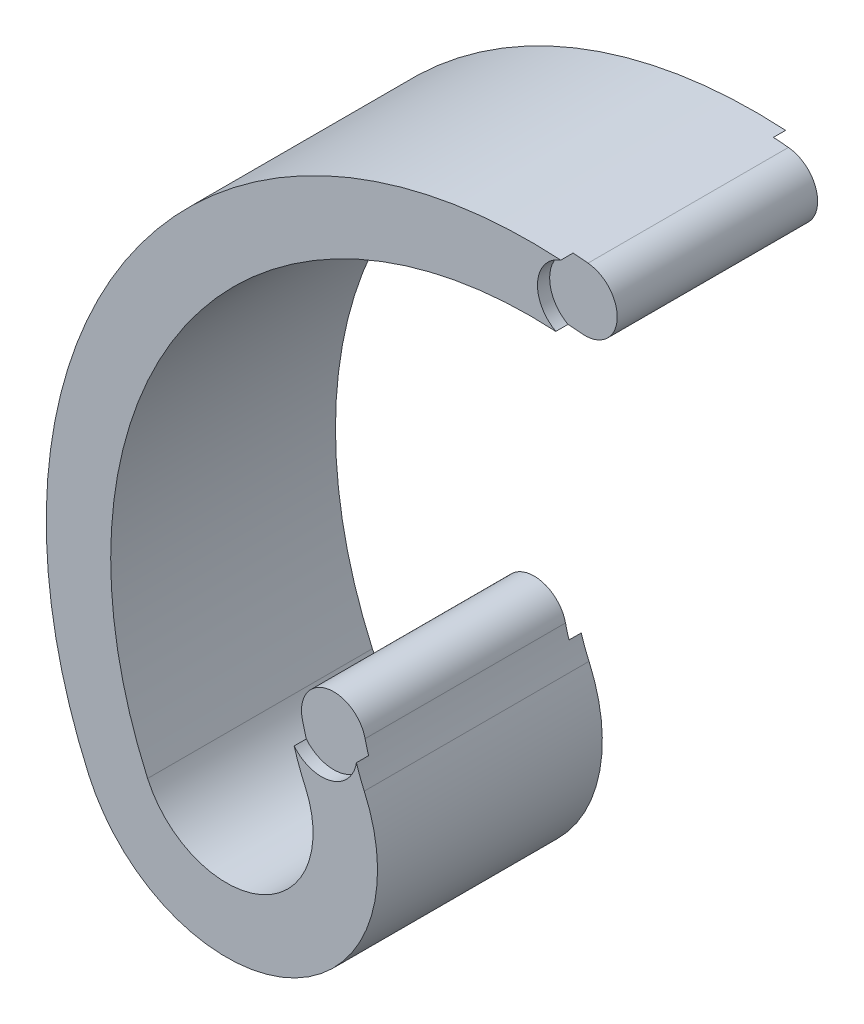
from build123d import *

# Parameters (mm, degrees)
LINEAR_AUSTRAGEN_D_NN1_DEPTH    = 143
SKIZZE2_R                       = 41
LINEAR_AUSTRAGEN1_DEPTH         = 286
SKIZZE3_R                       = 45
SCHNITT_LINEAR_AUSTRAGEN1_DEPTH = 15.5


with BuildPart() as part:
    # Skizze1 → Linear-Austragen-D_nn1 (new, symmetric)
    with BuildSketch(Plane.XY):
        with BuildLine():
            ThreePointArc((-305.946239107, -70.735690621), (-297.599415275, -100.205923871), (-286.421168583, -128.722777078))
            ThreePointArc((-286.421168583, -128.722777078), (-341.733085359, -274.332425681), (-487.342733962, -219.020508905))
            ThreePointArc((-487.342733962, -219.020508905), (-434.536676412, 310.887118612), (49.940811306, 531.957553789))
            Line((49.940811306, 531.957553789), (57.605366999, 613.598564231))
            ThreePointArc((57.605366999, 613.598564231), (-501.226232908, 358.599832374), (-562.136583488, -252.63419768))
            ThreePointArc((-562.136583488, -252.63419768), (-308.119396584, -349.126275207), (-211.627319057, -95.109088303))
            ThreePointArc((-211.627319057, -95.109088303), (-219.88656327, -74.03890965), (-226.053760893, -52.264309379))
            Line((-226.053760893, -52.264309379), (-305.946239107, -70.735690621))
        make_face()
    extrude(amount=LINEAR_AUSTRAGEN_D_NN1_DEPTH, both=True)

    # Skizze2 → Linear austragen1 (add)
    with BuildSketch(Plane.XY.offset(143)):
        with Locations((53.773089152, 572.77805901)):
            Circle(SKIZZE2_R)
        with Locations((-266, -61.5)):
            Circle(SKIZZE2_R)
    extrude(amount=-LINEAR_AUSTRAGEN1_DEPTH)

    # Skizze3 → Schnitt-Linear austragen1 (cut)
    with BuildSketch(Plane.XY.offset(143)):
        with Locations((-266, -61.5)):
            Circle(SKIZZE3_R)
        with Locations((53.773089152, 572.77805901)):
            Circle(SKIZZE3_R)
    schnitt_linear_austragen1 = extrude(amount=-SCHNITT_LINEAR_AUSTRAGEN1_DEPTH, mode=Mode.SUBTRACT)

    # Spiegeln1: Schnitt-Linear austragen1 across plane
    add(schnitt_linear_austragen1.mirror(Plane.XY), mode=Mode.SUBTRACT)


solid = part.part
